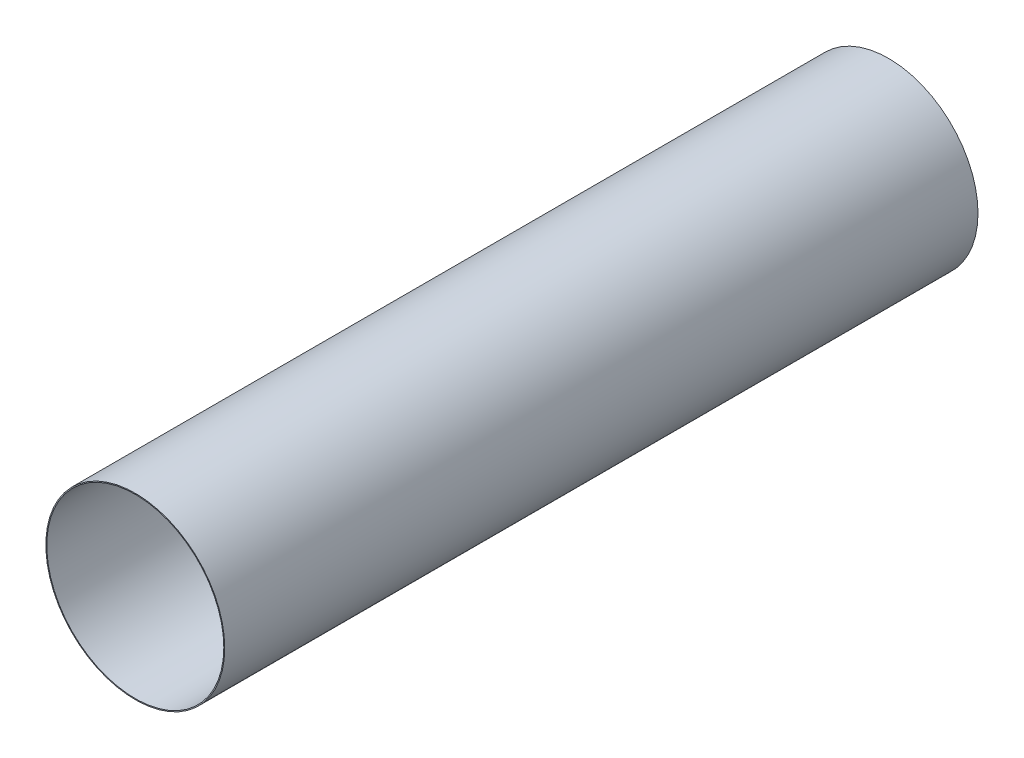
from build123d import *

# Parameters (mm, degrees)
SKETCH1_R           = 19
SKETCH1_R_2         = 18.8
BOSS_EXTRUDE1_DEPTH = 80


with BuildPart() as part:
    # Sketch1 → Boss-Extrude1 (new, symmetric)
    with BuildSketch(Plane.XY):
        Circle(SKETCH1_R)
        Circle(SKETCH1_R_2, mode=Mode.SUBTRACT)
    extrude(amount=BOSS_EXTRUDE1_DEPTH, both=True)


solid = part.part
